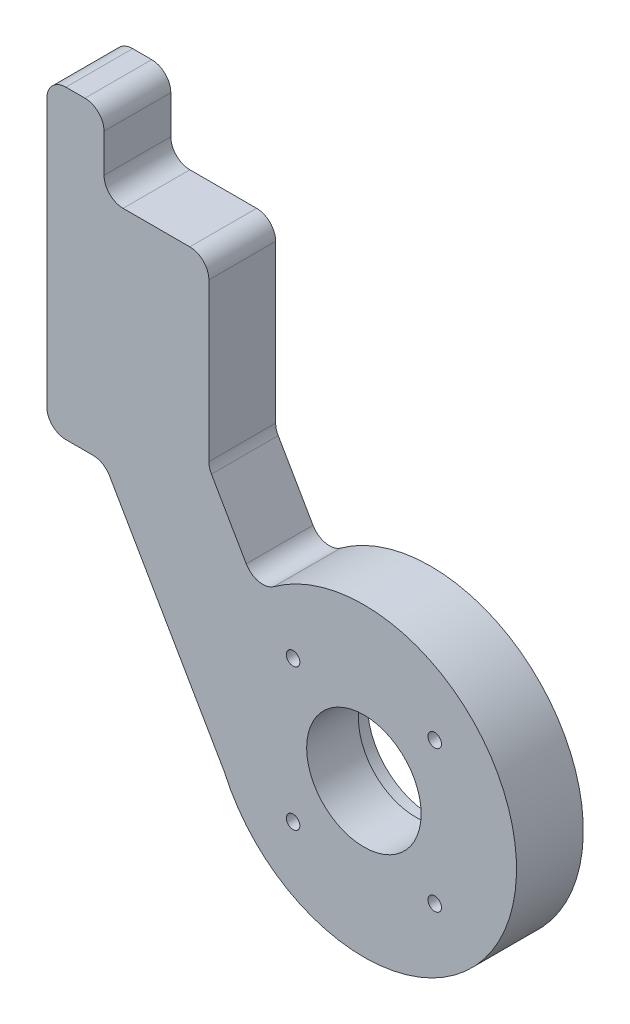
ISO-10303-21;
HEADER;
FILE_DESCRIPTION(('STEP AP214'),'2;1');
FILE_NAME('part.step','',(''),(''),'','','');
FILE_SCHEMA(('AUTOMOTIVE_DESIGN { 1 0 10303 214 1 1 1 1 }'));
ENDSEC;
DATA;
#1=APPLICATION_CONTEXT('core data for automotive mechanical design processes');
#2=APPLICATION_PROTOCOL_DEFINITION('international standard','automotive_design',2000,#1);
#3=PRODUCT_CONTEXT('',#1,'mechanical');
#4=PRODUCT('Part','Part','',(#3));
#5=PRODUCT_RELATED_PRODUCT_CATEGORY('part','',(#4));
#6=PRODUCT_DEFINITION_FORMATION('','',#4);
#7=PRODUCT_DEFINITION_CONTEXT('part definition',#1,'design');
#8=PRODUCT_DEFINITION('design','',#6,#7);
#9=PRODUCT_DEFINITION_SHAPE('','',#8);
#10=(LENGTH_UNIT() NAMED_UNIT(*) SI_UNIT(.MILLI.,.METRE.));
#11=(NAMED_UNIT(*) PLANE_ANGLE_UNIT() SI_UNIT($,.RADIAN.));
#12=(NAMED_UNIT(*) SI_UNIT($,.STERADIAN.) SOLID_ANGLE_UNIT());
#13=UNCERTAINTY_MEASURE_WITH_UNIT(LENGTH_MEASURE(1.E-05),#10,'distance_accuracy_value','');
#14=(GEOMETRIC_REPRESENTATION_CONTEXT(3) GLOBAL_UNCERTAINTY_ASSIGNED_CONTEXT((#13)) GLOBAL_UNIT_ASSIGNED_CONTEXT((#10,
#11,#12)) REPRESENTATION_CONTEXT('',''));
#15=CARTESIAN_POINT('',(0.,0.,0.));
#16=DIRECTION('',(0.,0.,1.));
#17=DIRECTION('',(1.,0.,0.));
#18=AXIS2_PLACEMENT_3D('',#15,#16,#17);
#19=CARTESIAN_POINT('',(-1.87442090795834,15.3373760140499,22.225));
#20=DIRECTION('',(0.,0.,-1.));
#21=DIRECTION('',(-1.,0.,0.));
#22=AXIS2_PLACEMENT_3D('',#19,#20,#21);
#23=CYLINDRICAL_SURFACE('',#22,19.05);
#24=CARTESIAN_POINT('',(-1.87442090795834,15.3373760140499,22.225));
#25=DIRECTION('',(0.,0.,1.));
#26=DIRECTION('',(1.,0.,0.));
#27=AXIS2_PLACEMENT_3D('',#24,#25,#26);
#28=CIRCLE('',#27,19.05);
#29=CARTESIAN_POINT('',(17.1755790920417,15.3373760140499,22.225));
#30=VERTEX_POINT('',#29);
#31=EDGE_CURVE('E206',#30,#30,#28,.T.);
#32=ORIENTED_EDGE('',*,*,#31,.T.);
#33=EDGE_LOOP('',(#32));
#34=FACE_BOUND('',#33,.T.);
#35=CARTESIAN_POINT('',(-1.87442090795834,15.3373760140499,5.));
#36=DIRECTION('',(0.,0.,-1.));
#37=DIRECTION('',(-1.,0.,0.));
#38=AXIS2_PLACEMENT_3D('',#35,#36,#37);
#39=CIRCLE('',#38,19.05);
#40=CARTESIAN_POINT('',(-20.9244209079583,15.3373760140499,5.));
#41=VERTEX_POINT('',#40);
#42=EDGE_CURVE('E51',#41,#41,#39,.T.);
#43=ORIENTED_EDGE('',*,*,#42,.T.);
#44=EDGE_LOOP('',(#43));
#45=FACE_BOUND('',#44,.T.);
#46=ADVANCED_FACE('F47',(#34,#45),#23,.F.);
#47=CARTESIAN_POINT('',(-1.87442090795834,15.3373760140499,22.225));
#48=DIRECTION('',(0.,0.,1.));
#49=DIRECTION('',(1.,0.,0.));
#50=AXIS2_PLACEMENT_3D('',#47,#48,#49);
#51=PLANE('',#50);
#52=CARTESIAN_POINT('',(-25.4444209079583,-8.23262398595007,22.225));
#53=DIRECTION('',(0.,0.,1.));
#54=DIRECTION('',(1.,0.,0.));
#55=AXIS2_PLACEMENT_3D('',#52,#53,#54);
#56=CIRCLE('',#55,2.25);
#57=CARTESIAN_POINT('',(-23.1944209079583,-8.23262398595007,22.225));
#58=VERTEX_POINT('',#57);
#59=EDGE_CURVE('E456',#58,#58,#56,.T.);
#60=ORIENTED_EDGE('',*,*,#59,.F.);
#61=EDGE_LOOP('',(#60));
#62=FACE_BOUND('',#61,.T.);
#63=CARTESIAN_POINT('',(21.6955790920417,-8.23262398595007,22.225));
#64=DIRECTION('',(0.,0.,1.));
#65=DIRECTION('',(1.,0.,0.));
#66=AXIS2_PLACEMENT_3D('',#63,#64,#65);
#67=CIRCLE('',#66,2.25);
#68=CARTESIAN_POINT('',(23.9455790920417,-8.23262398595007,22.225));
#69=VERTEX_POINT('',#68);
#70=EDGE_CURVE('E460',#69,#69,#67,.T.);
#71=ORIENTED_EDGE('',*,*,#70,.F.);
#72=EDGE_LOOP('',(#71));
#73=FACE_BOUND('',#72,.T.);
#74=CARTESIAN_POINT('',(21.6955790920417,38.9073760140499,22.225));
#75=DIRECTION('',(0.,0.,1.));
#76=DIRECTION('',(1.,0.,0.));
#77=AXIS2_PLACEMENT_3D('',#74,#75,#76);
#78=CIRCLE('',#77,2.25);
#79=CARTESIAN_POINT('',(23.9455790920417,38.9073760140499,22.225));
#80=VERTEX_POINT('',#79);
#81=EDGE_CURVE('E455',#80,#80,#78,.T.);
#82=ORIENTED_EDGE('',*,*,#81,.F.);
#83=EDGE_LOOP('',(#82));
#84=FACE_BOUND('',#83,.T.);
#85=CARTESIAN_POINT('',(-25.4444209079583,38.9073760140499,22.225));
#86=DIRECTION('',(0.,0.,1.));
#87=DIRECTION('',(1.,0.,0.));
#88=AXIS2_PLACEMENT_3D('',#85,#86,#87);
#89=CIRCLE('',#88,2.25);
#90=CARTESIAN_POINT('',(-23.1944209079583,38.9073760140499,22.225));
#91=VERTEX_POINT('',#90);
#92=EDGE_CURVE('E227',#91,#91,#89,.T.);
#93=ORIENTED_EDGE('',*,*,#92,.F.);
#94=EDGE_LOOP('',(#93));
#95=FACE_BOUND('',#94,.T.);
#96=DIRECTION('',(1.,0.,0.));
#97=VECTOR('',#96,1.);
#98=CARTESIAN_POINT('',(-107.408653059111,165.713354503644,22.225));
#99=LINE('',#98,#97);
#100=CARTESIAN_POINT('',(-101.058653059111,165.713354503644,22.225));
#101=VERTEX_POINT('',#100);
#102=CARTESIAN_POINT('',(-94.7086530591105,165.713354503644,22.225));
#103=VERTEX_POINT('',#102);
#104=EDGE_CURVE('E382',#101,#103,#99,.T.);
#105=ORIENTED_EDGE('',*,*,#104,.F.);
#106=CARTESIAN_POINT('',(-101.058653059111,159.363354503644,22.225));
#107=DIRECTION('',(0.,0.,1.));
#108=DIRECTION('',(1.,0.,0.));
#109=AXIS2_PLACEMENT_3D('',#106,#107,#108);
#110=CIRCLE('',#109,6.35);
#111=CARTESIAN_POINT('',(-107.408653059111,159.363354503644,22.225));
#112=VERTEX_POINT('',#111);
#113=EDGE_CURVE('E282',#101,#112,#110,.T.);
#114=ORIENTED_EDGE('',*,*,#113,.T.);
#115=DIRECTION('',(0.,1.,0.));
#116=VECTOR('',#115,1.);
#117=CARTESIAN_POINT('',(-107.408653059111,64.1133545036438,22.225));
#118=LINE('',#117,#116);
#119=CARTESIAN_POINT('',(-107.408653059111,70.4633545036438,22.225));
#120=VERTEX_POINT('',#119);
#121=EDGE_CURVE('E372',#120,#112,#118,.T.);
#122=ORIENTED_EDGE('',*,*,#121,.F.);
#123=CARTESIAN_POINT('',(-101.058653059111,70.4633545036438,22.225));
#124=DIRECTION('',(0.,0.,1.));
#125=DIRECTION('',(1.,0.,0.));
#126=AXIS2_PLACEMENT_3D('',#123,#124,#125);
#127=CIRCLE('',#126,6.35);
#128=CARTESIAN_POINT('',(-101.058653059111,64.1133545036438,22.225));
#129=VERTEX_POINT('',#128);
#130=EDGE_CURVE('E71',#120,#129,#127,.T.);
#131=ORIENTED_EDGE('',*,*,#130,.T.);
#132=DIRECTION('',(1.,0.,0.));
#133=VECTOR('',#132,1.);
#134=CARTESIAN_POINT('',(-107.408653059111,64.1133545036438,22.225));
#135=LINE('',#134,#133);
#136=CARTESIAN_POINT('',(-92.0248272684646,64.1133545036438,22.225));
#137=VERTEX_POINT('',#136);
#138=EDGE_CURVE('E386',#129,#137,#135,.T.);
#139=ORIENTED_EDGE('',*,*,#138,.T.);
#140=CARTESIAN_POINT('',(-92.0248272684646,57.7633545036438,22.225));
#141=DIRECTION('',(0.,0.,1.));
#142=DIRECTION('',(1.,0.,0.));
#143=AXIS2_PLACEMENT_3D('',#140,#141,#142);
#144=CIRCLE('',#143,6.35);
#145=CARTESIAN_POINT('',(-86.5255659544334,60.9383545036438,22.225));
#146=VERTEX_POINT('',#145);
#147=EDGE_CURVE('E322',#137,#146,#144,.F.);
#148=ORIENTED_EDGE('',*,*,#147,.T.);
#149=DIRECTION('',(0.5,-0.866025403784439,0.));
#150=VECTOR('',#149,1.);
#151=CARTESIAN_POINT('',(-121.354220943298,121.263354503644,22.225));
#152=LINE('',#151,#150);
#153=CARTESIAN_POINT('',(-48.4942042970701,-4.9338961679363,22.225));
#154=VERTEX_POINT('',#153);
#155=EDGE_CURVE('E217',#146,#154,#152,.T.);
#156=ORIENTED_EDGE('',*,*,#155,.T.);
#157=CARTESIAN_POINT('',(-53.9934656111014,-8.10889616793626,22.225));
#158=DIRECTION('',(0.,0.,1.));
#159=DIRECTION('',(1.,0.,0.));
#160=AXIS2_PLACEMENT_3D('',#157,#158,#159);
#161=CIRCLE('',#160,6.35);
#162=CARTESIAN_POINT('',(-48.2024606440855,-5.50375481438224,22.225));
#163=VERTEX_POINT('',#162);
#164=EDGE_CURVE('E185',#154,#163,#161,.F.);
#165=ORIENTED_EDGE('',*,*,#164,.T.);
#166=CARTESIAN_POINT('',(-1.87442090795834,15.3373760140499,22.225));
#167=DIRECTION('',(0.,0.,1.));
#168=DIRECTION('',(1.,0.,0.));
#169=AXIS2_PLACEMENT_3D('',#166,#167,#168);
#170=CIRCLE('',#169,50.8);
#171=CARTESIAN_POINT('',(-31.7958882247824,56.3903392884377,22.225));
#172=VERTEX_POINT('',#171);
#173=EDGE_CURVE('E195',#163,#172,#170,.T.);
#174=ORIENTED_EDGE('',*,*,#173,.T.);
#175=CARTESIAN_POINT('',(-35.5360716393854,61.5219596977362,22.225));
#176=DIRECTION('',(0.,0.,1.));
#177=DIRECTION('',(1.,0.,0.));
#178=AXIS2_PLACEMENT_3D('',#175,#176,#177);
#179=CIRCLE('',#178,6.35);
#180=CARTESIAN_POINT('',(-41.0353329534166,58.3469596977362,22.225));
#181=VERTEX_POINT('',#180);
#182=EDGE_CURVE('E327',#172,#181,#179,.F.);
#183=ORIENTED_EDGE('',*,*,#182,.T.);
#184=DIRECTION('',(-0.5,0.866025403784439,0.));
#185=VECTOR('',#184,1.);
#186=CARTESIAN_POINT('',(-37.2518930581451,51.7938495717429,22.225));
#187=LINE('',#186,#185);
#188=CARTESIAN_POINT('',(-52.6131078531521,78.4002540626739,22.225));
#189=VERTEX_POINT('',#188);
#190=EDGE_CURVE('E392',#181,#189,#187,.T.);
#191=ORIENTED_EDGE('',*,*,#190,.T.);
#192=CARTESIAN_POINT('',(-47.113846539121,81.5752540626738,22.225));
#193=DIRECTION('',(0.,0.,1.));
#194=DIRECTION('',(1.,0.,0.));
#195=AXIS2_PLACEMENT_3D('',#192,#193,#194);
#196=CIRCLE('',#195,6.35);
#197=CARTESIAN_POINT('',(-53.463846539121,81.5752540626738,22.225));
#198=VERTEX_POINT('',#197);
#199=EDGE_CURVE('E333',#189,#198,#196,.F.);
#200=ORIENTED_EDGE('',*,*,#199,.T.);
#201=DIRECTION('',(0.,-1.,0.));
#202=VECTOR('',#201,1.);
#203=CARTESIAN_POINT('',(-53.463846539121,140.313354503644,22.225));
#204=LINE('',#203,#202);
#205=CARTESIAN_POINT('',(-53.463846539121,133.963354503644,22.225));
#206=VERTEX_POINT('',#205);
#207=EDGE_CURVE('E433',#206,#198,#204,.T.);
#208=ORIENTED_EDGE('',*,*,#207,.F.);
#209=CARTESIAN_POINT('',(-59.813846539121,133.963354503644,22.225));
#210=DIRECTION('',(0.,0.,1.));
#211=DIRECTION('',(1.,0.,0.));
#212=AXIS2_PLACEMENT_3D('',#209,#210,#211);
#213=CIRCLE('',#212,6.35);
#214=CARTESIAN_POINT('',(-59.813846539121,140.313354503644,22.225));
#215=VERTEX_POINT('',#214);
#216=EDGE_CURVE('E277',#206,#215,#213,.T.);
#217=ORIENTED_EDGE('',*,*,#216,.T.);
#218=DIRECTION('',(1.,0.,0.));
#219=VECTOR('',#218,1.);
#220=CARTESIAN_POINT('',(-88.3586530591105,140.313354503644,22.225));
#221=LINE('',#220,#219);
#222=CARTESIAN_POINT('',(-82.0086530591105,140.313354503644,22.225));
#223=VERTEX_POINT('',#222);
#224=EDGE_CURVE('E362',#223,#215,#221,.T.);
#225=ORIENTED_EDGE('',*,*,#224,.F.);
#226=CARTESIAN_POINT('',(-82.0086530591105,146.663354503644,22.225));
#227=DIRECTION('',(0.,0.,1.));
#228=DIRECTION('',(1.,0.,0.));
#229=AXIS2_PLACEMENT_3D('',#226,#227,#228);
#230=CIRCLE('',#229,6.35);
#231=CARTESIAN_POINT('',(-88.3586530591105,146.663354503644,22.225));
#232=VERTEX_POINT('',#231);
#233=EDGE_CURVE('E11',#223,#232,#230,.F.);
#234=ORIENTED_EDGE('',*,*,#233,.T.);
#235=DIRECTION('',(0.,1.,0.));
#236=VECTOR('',#235,1.);
#237=CARTESIAN_POINT('',(-88.3586530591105,64.1133545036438,22.225));
#238=LINE('',#237,#236);
#239=CARTESIAN_POINT('',(-88.3586530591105,159.363354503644,22.225));
#240=VERTEX_POINT('',#239);
#241=EDGE_CURVE('E360',#232,#240,#238,.T.);
#242=ORIENTED_EDGE('',*,*,#241,.T.);
#243=CARTESIAN_POINT('',(-94.7086530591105,159.363354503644,22.225));
#244=DIRECTION('',(0.,0.,1.));
#245=DIRECTION('',(1.,0.,0.));
#246=AXIS2_PLACEMENT_3D('',#243,#244,#245);
#247=CIRCLE('',#246,6.35);
#248=EDGE_CURVE('E274',#240,#103,#247,.T.);
#249=ORIENTED_EDGE('',*,*,#248,.T.);
#250=EDGE_LOOP('',(#105,#114,#122,#131,#139,#148,#156,#165,#174,#183,#191,#200,#208,#217,#225,
#234,#242,#249));
#251=FACE_BOUND('',#250,.T.);
#252=ORIENTED_EDGE('',*,*,#31,.F.);
#253=EDGE_LOOP('',(#252));
#254=FACE_BOUND('',#253,.T.);
#255=ADVANCED_FACE('F358',(#62,#73,#84,#95,#251,#254),#51,.T.);
#256=CARTESIAN_POINT('',(-1.87442090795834,15.3373760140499,0.));
#257=DIRECTION('',(0.,0.,1.));
#258=DIRECTION('',(1.,0.,0.));
#259=AXIS2_PLACEMENT_3D('',#256,#257,#258);
#260=PLANE('',#259);
#261=CARTESIAN_POINT('',(-1.87442090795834,15.3373760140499,0.));
#262=DIRECTION('',(0.,0.,-1.));
#263=DIRECTION('',(-1.,0.,0.));
#264=AXIS2_PLACEMENT_3D('',#261,#262,#263);
#265=CIRCLE('',#264,21.);
#266=CARTESIAN_POINT('',(-22.8744209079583,15.3373760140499,0.));
#267=VERTEX_POINT('',#266);
#268=EDGE_CURVE('E467',#267,#267,#265,.T.);
#269=ORIENTED_EDGE('',*,*,#268,.F.);
#270=EDGE_LOOP('',(#269));
#271=FACE_BOUND('',#270,.T.);
#272=CARTESIAN_POINT('',(-25.4444209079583,-8.23262398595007,0.));
#273=DIRECTION('',(0.,0.,1.));
#274=DIRECTION('',(1.,0.,0.));
#275=AXIS2_PLACEMENT_3D('',#272,#273,#274);
#276=CIRCLE('',#275,2.25);
#277=CARTESIAN_POINT('',(-23.1944209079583,-8.23262398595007,0.));
#278=VERTEX_POINT('',#277);
#279=EDGE_CURVE('E235',#278,#278,#276,.T.);
#280=ORIENTED_EDGE('',*,*,#279,.T.);
#281=EDGE_LOOP('',(#280));
#282=FACE_BOUND('',#281,.T.);
#283=CARTESIAN_POINT('',(21.6955790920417,-8.23262398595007,0.));
#284=DIRECTION('',(0.,0.,1.));
#285=DIRECTION('',(1.,0.,0.));
#286=AXIS2_PLACEMENT_3D('',#283,#284,#285);
#287=CIRCLE('',#286,2.25);
#288=CARTESIAN_POINT('',(23.9455790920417,-8.23262398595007,0.));
#289=VERTEX_POINT('',#288);
#290=EDGE_CURVE('E231',#289,#289,#287,.T.);
#291=ORIENTED_EDGE('',*,*,#290,.T.);
#292=EDGE_LOOP('',(#291));
#293=FACE_BOUND('',#292,.T.);
#294=CARTESIAN_POINT('',(21.6955790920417,38.9073760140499,0.));
#295=DIRECTION('',(0.,0.,1.));
#296=DIRECTION('',(1.,0.,0.));
#297=AXIS2_PLACEMENT_3D('',#294,#295,#296);
#298=CIRCLE('',#297,2.25);
#299=CARTESIAN_POINT('',(23.9455790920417,38.9073760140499,0.));
#300=VERTEX_POINT('',#299);
#301=EDGE_CURVE('E226',#300,#300,#298,.T.);
#302=ORIENTED_EDGE('',*,*,#301,.T.);
#303=EDGE_LOOP('',(#302));
#304=FACE_BOUND('',#303,.T.);
#305=CARTESIAN_POINT('',(-25.4444209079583,38.9073760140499,0.));
#306=DIRECTION('',(0.,0.,1.));
#307=DIRECTION('',(1.,0.,0.));
#308=AXIS2_PLACEMENT_3D('',#305,#306,#307);
#309=CIRCLE('',#308,2.25);
#310=CARTESIAN_POINT('',(-23.1944209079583,38.9073760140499,0.));
#311=VERTEX_POINT('',#310);
#312=EDGE_CURVE('E222',#311,#311,#309,.T.);
#313=ORIENTED_EDGE('',*,*,#312,.T.);
#314=EDGE_LOOP('',(#313));
#315=FACE_BOUND('',#314,.T.);
#316=DIRECTION('',(0.,-1.,0.));
#317=VECTOR('',#316,1.);
#318=CARTESIAN_POINT('',(-107.408653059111,64.1133545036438,0.));
#319=LINE('',#318,#317);
#320=CARTESIAN_POINT('',(-107.408653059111,159.363354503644,0.));
#321=VERTEX_POINT('',#320);
#322=CARTESIAN_POINT('',(-107.408653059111,70.4633545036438,0.));
#323=VERTEX_POINT('',#322);
#324=EDGE_CURVE('E367',#321,#323,#319,.T.);
#325=ORIENTED_EDGE('',*,*,#324,.F.);
#326=CARTESIAN_POINT('',(-101.058653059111,159.363354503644,0.));
#327=DIRECTION('',(0.,0.,1.));
#328=DIRECTION('',(1.,0.,0.));
#329=AXIS2_PLACEMENT_3D('',#326,#327,#328);
#330=CIRCLE('',#329,6.35);
#331=CARTESIAN_POINT('',(-101.058653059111,165.713354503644,0.));
#332=VERTEX_POINT('',#331);
#333=EDGE_CURVE('E264',#321,#332,#330,.F.);
#334=ORIENTED_EDGE('',*,*,#333,.T.);
#335=DIRECTION('',(1.,0.,0.));
#336=VECTOR('',#335,1.);
#337=CARTESIAN_POINT('',(-107.408653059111,165.713354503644,0.));
#338=LINE('',#337,#336);
#339=CARTESIAN_POINT('',(-94.7086530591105,165.713354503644,0.));
#340=VERTEX_POINT('',#339);
#341=EDGE_CURVE('E378',#332,#340,#338,.T.);
#342=ORIENTED_EDGE('',*,*,#341,.T.);
#343=CARTESIAN_POINT('',(-94.7086530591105,159.363354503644,0.));
#344=DIRECTION('',(0.,0.,1.));
#345=DIRECTION('',(1.,0.,0.));
#346=AXIS2_PLACEMENT_3D('',#343,#344,#345);
#347=CIRCLE('',#346,6.35);
#348=CARTESIAN_POINT('',(-88.3586530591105,159.363354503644,0.));
#349=VERTEX_POINT('',#348);
#350=EDGE_CURVE('E255',#340,#349,#347,.F.);
#351=ORIENTED_EDGE('',*,*,#350,.T.);
#352=DIRECTION('',(0.,-1.,0.));
#353=VECTOR('',#352,1.);
#354=CARTESIAN_POINT('',(-88.3586530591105,64.1133545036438,0.));
#355=LINE('',#354,#353);
#356=CARTESIAN_POINT('',(-88.3586530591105,146.663354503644,0.));
#357=VERTEX_POINT('',#356);
#358=EDGE_CURVE('E341',#349,#357,#355,.T.);
#359=ORIENTED_EDGE('',*,*,#358,.T.);
#360=CARTESIAN_POINT('',(-82.0086530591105,146.663354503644,0.));
#361=DIRECTION('',(0.,0.,1.));
#362=DIRECTION('',(1.,0.,0.));
#363=AXIS2_PLACEMENT_3D('',#360,#361,#362);
#364=CIRCLE('',#363,6.35);
#365=CARTESIAN_POINT('',(-82.0086530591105,140.313354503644,0.));
#366=VERTEX_POINT('',#365);
#367=EDGE_CURVE('E57',#357,#366,#364,.T.);
#368=ORIENTED_EDGE('',*,*,#367,.T.);
#369=DIRECTION('',(1.,0.,0.));
#370=VECTOR('',#369,1.);
#371=CARTESIAN_POINT('',(-88.3586530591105,140.313354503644,0.));
#372=LINE('',#371,#370);
#373=CARTESIAN_POINT('',(-59.813846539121,140.313354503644,0.));
#374=VERTEX_POINT('',#373);
#375=EDGE_CURVE('E239',#366,#374,#372,.T.);
#376=ORIENTED_EDGE('',*,*,#375,.T.);
#377=CARTESIAN_POINT('',(-59.813846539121,133.963354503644,0.));
#378=DIRECTION('',(0.,0.,1.));
#379=DIRECTION('',(1.,0.,0.));
#380=AXIS2_PLACEMENT_3D('',#377,#378,#379);
#381=CIRCLE('',#380,6.35);
#382=CARTESIAN_POINT('',(-53.463846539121,133.963354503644,0.));
#383=VERTEX_POINT('',#382);
#384=EDGE_CURVE('E258',#374,#383,#381,.F.);
#385=ORIENTED_EDGE('',*,*,#384,.T.);
#386=DIRECTION('',(0.,-1.,0.));
#387=VECTOR('',#386,1.);
#388=CARTESIAN_POINT('',(-53.463846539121,140.313354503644,0.));
#389=LINE('',#388,#387);
#390=CARTESIAN_POINT('',(-53.463846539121,81.5752540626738,0.));
#391=VERTEX_POINT('',#390);
#392=EDGE_CURVE('E351',#383,#391,#389,.T.);
#393=ORIENTED_EDGE('',*,*,#392,.T.);
#394=CARTESIAN_POINT('',(-47.113846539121,81.5752540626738,0.));
#395=DIRECTION('',(0.,0.,1.));
#396=DIRECTION('',(1.,0.,0.));
#397=AXIS2_PLACEMENT_3D('',#394,#395,#396);
#398=CIRCLE('',#397,6.35);
#399=CARTESIAN_POINT('',(-52.6131078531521,78.4002540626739,0.));
#400=VERTEX_POINT('',#399);
#401=EDGE_CURVE('E330',#391,#400,#398,.T.);
#402=ORIENTED_EDGE('',*,*,#401,.T.);
#403=DIRECTION('',(-0.5,0.866025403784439,0.));
#404=VECTOR('',#403,1.);
#405=CARTESIAN_POINT('',(-37.2518930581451,51.7938495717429,0.));
#406=LINE('',#405,#404);
#407=CARTESIAN_POINT('',(-41.0353329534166,58.3469596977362,0.));
#408=VERTEX_POINT('',#407);
#409=EDGE_CURVE('E205',#408,#400,#406,.T.);
#410=ORIENTED_EDGE('',*,*,#409,.F.);
#411=CARTESIAN_POINT('',(-35.5360716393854,61.5219596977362,0.));
#412=DIRECTION('',(0.,0.,1.));
#413=DIRECTION('',(1.,0.,0.));
#414=AXIS2_PLACEMENT_3D('',#411,#412,#413);
#415=CIRCLE('',#414,6.35);
#416=CARTESIAN_POINT('',(-31.7958882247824,56.3903392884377,0.));
#417=VERTEX_POINT('',#416);
#418=EDGE_CURVE('E203',#408,#417,#415,.T.);
#419=ORIENTED_EDGE('',*,*,#418,.T.);
#420=CARTESIAN_POINT('',(-1.87442090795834,15.3373760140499,0.));
#421=DIRECTION('',(0.,0.,1.));
#422=DIRECTION('',(1.,0.,0.));
#423=AXIS2_PLACEMENT_3D('',#420,#421,#422);
#424=CIRCLE('',#423,50.8);
#425=CARTESIAN_POINT('',(-48.2024606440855,-5.50375481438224,0.));
#426=VERTEX_POINT('',#425);
#427=EDGE_CURVE('E192',#426,#417,#424,.T.);
#428=ORIENTED_EDGE('',*,*,#427,.F.);
#429=CARTESIAN_POINT('',(-53.9934656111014,-8.10889616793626,0.));
#430=DIRECTION('',(0.,0.,1.));
#431=DIRECTION('',(1.,0.,0.));
#432=AXIS2_PLACEMENT_3D('',#429,#430,#431);
#433=CIRCLE('',#432,6.35);
#434=CARTESIAN_POINT('',(-48.4942042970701,-4.9338961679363,0.));
#435=VERTEX_POINT('',#434);
#436=EDGE_CURVE('E174',#426,#435,#433,.T.);
#437=ORIENTED_EDGE('',*,*,#436,.T.);
#438=DIRECTION('',(0.5,-0.866025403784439,0.));
#439=VECTOR('',#438,1.);
#440=CARTESIAN_POINT('',(-121.354220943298,121.263354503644,0.));
#441=LINE('',#440,#439);
#442=CARTESIAN_POINT('',(-86.5255659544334,60.9383545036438,0.));
#443=VERTEX_POINT('',#442);
#444=EDGE_CURVE('E211',#443,#435,#441,.T.);
#445=ORIENTED_EDGE('',*,*,#444,.F.);
#446=CARTESIAN_POINT('',(-92.0248272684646,57.7633545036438,0.));
#447=DIRECTION('',(0.,0.,1.));
#448=DIRECTION('',(1.,0.,0.));
#449=AXIS2_PLACEMENT_3D('',#446,#447,#448);
#450=CIRCLE('',#449,6.35);
#451=CARTESIAN_POINT('',(-92.0248272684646,64.1133545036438,0.));
#452=VERTEX_POINT('',#451);
#453=EDGE_CURVE('E319',#443,#452,#450,.T.);
#454=ORIENTED_EDGE('',*,*,#453,.T.);
#455=DIRECTION('',(1.,0.,0.));
#456=VECTOR('',#455,1.);
#457=CARTESIAN_POINT('',(-107.408653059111,64.1133545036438,0.));
#458=LINE('',#457,#456);
#459=CARTESIAN_POINT('',(-101.058653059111,64.1133545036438,0.));
#460=VERTEX_POINT('',#459);
#461=EDGE_CURVE('E214',#460,#452,#458,.T.);
#462=ORIENTED_EDGE('',*,*,#461,.F.);
#463=CARTESIAN_POINT('',(-101.058653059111,70.4633545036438,0.));
#464=DIRECTION('',(0.,0.,1.));
#465=DIRECTION('',(1.,0.,0.));
#466=AXIS2_PLACEMENT_3D('',#463,#464,#465);
#467=CIRCLE('',#466,6.35);
#468=EDGE_CURVE('E261',#460,#323,#467,.F.);
#469=ORIENTED_EDGE('',*,*,#468,.T.);
#470=EDGE_LOOP('',(#325,#334,#342,#351,#359,#368,#376,#385,#393,#402,#410,#419,#428,#437,#445,
#454,#462,#469));
#471=FACE_BOUND('',#470,.T.);
#472=ADVANCED_FACE('F201',(#271,#282,#293,#304,#315,#471),#260,.F.);
#473=CARTESIAN_POINT('',(-1.87442090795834,15.3373760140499,22.225));
#474=DIRECTION('',(0.,0.,-1.));
#475=DIRECTION('',(-1.,0.,0.));
#476=AXIS2_PLACEMENT_3D('',#473,#474,#475);
#477=CYLINDRICAL_SURFACE('',#476,50.8);
#478=ORIENTED_EDGE('',*,*,#173,.F.);
#479=DIRECTION('',(0.,0.,-1.));
#480=VECTOR('',#479,1.);
#481=CARTESIAN_POINT('',(-48.2024606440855,-5.50375481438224,22.225));
#482=LINE('',#481,#480);
#483=EDGE_CURVE('E178',#163,#426,#482,.T.);
#484=ORIENTED_EDGE('',*,*,#483,.T.);
#485=ORIENTED_EDGE('',*,*,#427,.T.);
#486=DIRECTION('',(0.,0.,-1.));
#487=VECTOR('',#486,1.);
#488=CARTESIAN_POINT('',(-31.7958882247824,56.3903392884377,22.225));
#489=LINE('',#488,#487);
#490=EDGE_CURVE('E198',#417,#172,#489,.F.);
#491=ORIENTED_EDGE('',*,*,#490,.T.);
#492=EDGE_LOOP('',(#478,#484,#485,#491));
#493=FACE_BOUND('',#492,.T.);
#494=ADVANCED_FACE('F191',(#493),#477,.T.);
#495=CARTESIAN_POINT('',(-37.2518930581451,51.7938495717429,22.225));
#496=DIRECTION('',(-0.866025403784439,-0.5,0.));
#497=DIRECTION('',(0.5,-0.866025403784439,0.));
#498=AXIS2_PLACEMENT_3D('',#495,#496,#497);
#499=PLANE('',#498);
#500=ORIENTED_EDGE('',*,*,#190,.F.);
#501=DIRECTION('',(0.,0.,1.));
#502=VECTOR('',#501,1.);
#503=CARTESIAN_POINT('',(-41.0353329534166,58.3469596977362,0.));
#504=LINE('',#503,#502);
#505=EDGE_CURVE('E293',#181,#408,#504,.F.);
#506=ORIENTED_EDGE('',*,*,#505,.T.);
#507=ORIENTED_EDGE('',*,*,#409,.T.);
#508=DIRECTION('',(0.,0.,-1.));
#509=VECTOR('',#508,1.);
#510=CARTESIAN_POINT('',(-52.6131078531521,78.4002540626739,22.225));
#511=LINE('',#510,#509);
#512=EDGE_CURVE('E290',#400,#189,#511,.F.);
#513=ORIENTED_EDGE('',*,*,#512,.T.);
#514=EDGE_LOOP('',(#500,#506,#507,#513));
#515=FACE_BOUND('',#514,.T.);
#516=ADVANCED_FACE('F507',(#515),#499,.F.);
#517=CARTESIAN_POINT('',(-121.354220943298,121.263354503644,22.225));
#518=DIRECTION('',(0.866025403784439,0.5,0.));
#519=DIRECTION('',(-0.5,0.866025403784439,0.));
#520=AXIS2_PLACEMENT_3D('',#517,#518,#519);
#521=PLANE('',#520);
#522=ORIENTED_EDGE('',*,*,#444,.T.);
#523=DIRECTION('',(0.,0.,1.));
#524=VECTOR('',#523,1.);
#525=CARTESIAN_POINT('',(-48.4942042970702,-4.93389616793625,22.225));
#526=LINE('',#525,#524);
#527=EDGE_CURVE('E179',#435,#154,#526,.T.);
#528=ORIENTED_EDGE('',*,*,#527,.T.);
#529=ORIENTED_EDGE('',*,*,#155,.F.);
#530=DIRECTION('',(0.,0.,-1.));
#531=VECTOR('',#530,1.);
#532=CARTESIAN_POINT('',(-86.5255659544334,60.9383545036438,0.));
#533=LINE('',#532,#531);
#534=EDGE_CURVE('E197',#146,#443,#533,.T.);
#535=ORIENTED_EDGE('',*,*,#534,.T.);
#536=EDGE_LOOP('',(#522,#528,#529,#535));
#537=FACE_BOUND('',#536,.T.);
#538=ADVANCED_FACE('F403',(#537),#521,.F.);
#539=CARTESIAN_POINT('',(-107.408653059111,64.1133545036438,0.));
#540=DIRECTION('',(0.,1.,0.));
#541=DIRECTION('',(0.,0.,1.));
#542=AXIS2_PLACEMENT_3D('',#539,#540,#541);
#543=PLANE('',#542);
#544=ORIENTED_EDGE('',*,*,#461,.T.);
#545=DIRECTION('',(0.,0.,-1.));
#546=VECTOR('',#545,1.);
#547=CARTESIAN_POINT('',(-92.0248272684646,64.1133545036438,22.225));
#548=LINE('',#547,#546);
#549=EDGE_CURVE('E64',#452,#137,#548,.F.);
#550=ORIENTED_EDGE('',*,*,#549,.T.);
#551=ORIENTED_EDGE('',*,*,#138,.F.);
#552=DIRECTION('',(0.,0.,1.));
#553=VECTOR('',#552,1.);
#554=CARTESIAN_POINT('',(-101.058653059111,64.1133545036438,0.));
#555=LINE('',#554,#553);
#556=EDGE_CURVE('E285',#129,#460,#555,.F.);
#557=ORIENTED_EDGE('',*,*,#556,.T.);
#558=EDGE_LOOP('',(#544,#550,#551,#557));
#559=FACE_BOUND('',#558,.T.);
#560=ADVANCED_FACE('F408',(#559),#543,.F.);
#561=CARTESIAN_POINT('',(-107.408653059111,165.713354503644,0.));
#562=DIRECTION('',(0.,-1.,0.));
#563=DIRECTION('',(0.,0.,-1.));
#564=AXIS2_PLACEMENT_3D('',#561,#562,#563);
#565=PLANE('',#564);
#566=ORIENTED_EDGE('',*,*,#341,.F.);
#567=DIRECTION('',(0.,0.,-1.));
#568=VECTOR('',#567,1.);
#569=CARTESIAN_POINT('',(-101.058653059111,165.713354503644,0.));
#570=LINE('',#569,#568);
#571=EDGE_CURVE('E271',#332,#101,#570,.F.);
#572=ORIENTED_EDGE('',*,*,#571,.T.);
#573=ORIENTED_EDGE('',*,*,#104,.T.);
#574=DIRECTION('',(0.,0.,-1.));
#575=VECTOR('',#574,1.);
#576=CARTESIAN_POINT('',(-94.7086530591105,165.713354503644,0.));
#577=LINE('',#576,#575);
#578=EDGE_CURVE('E267',#103,#340,#577,.T.);
#579=ORIENTED_EDGE('',*,*,#578,.T.);
#580=EDGE_LOOP('',(#566,#572,#573,#579));
#581=FACE_BOUND('',#580,.T.);
#582=ADVANCED_FACE('F423',(#581),#565,.F.);
#583=CARTESIAN_POINT('',(-107.408653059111,0.,0.));
#584=DIRECTION('',(1.,0.,0.));
#585=DIRECTION('',(0.,0.,-1.));
#586=AXIS2_PLACEMENT_3D('',#583,#584,#585);
#587=PLANE('',#586);
#588=CARTESIAN_POINT('',(-107.408653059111,153.013354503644,11.1125));
#589=DIRECTION('',(-1.,0.,0.));
#590=DIRECTION('',(0.,0.,1.));
#591=AXIS2_PLACEMENT_3D('',#588,#589,#590);
#592=CIRCLE('',#591,4.6);
#593=CARTESIAN_POINT('',(-107.408653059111,153.013354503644,15.7125));
#594=VERTEX_POINT('',#593);
#595=EDGE_CURVE('E437',#594,#594,#592,.T.);
#596=ORIENTED_EDGE('',*,*,#595,.F.);
#597=EDGE_LOOP('',(#596));
#598=FACE_BOUND('',#597,.T.);
#599=CARTESIAN_POINT('',(-107.408653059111,76.8133545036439,11.1125));
#600=DIRECTION('',(-1.,0.,0.));
#601=DIRECTION('',(0.,0.,1.));
#602=AXIS2_PLACEMENT_3D('',#599,#600,#601);
#603=CIRCLE('',#602,4.6);
#604=CARTESIAN_POINT('',(-107.408653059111,76.8133545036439,15.7125));
#605=VERTEX_POINT('',#604);
#606=EDGE_CURVE('E432',#605,#605,#603,.T.);
#607=ORIENTED_EDGE('',*,*,#606,.F.);
#608=EDGE_LOOP('',(#607));
#609=FACE_BOUND('',#608,.T.);
#610=ORIENTED_EDGE('',*,*,#121,.T.);
#611=DIRECTION('',(0.,0.,-1.));
#612=VECTOR('',#611,1.);
#613=CARTESIAN_POINT('',(-107.408653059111,159.363354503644,0.));
#614=LINE('',#613,#612);
#615=EDGE_CURVE('E251',#112,#321,#614,.T.);
#616=ORIENTED_EDGE('',*,*,#615,.T.);
#617=ORIENTED_EDGE('',*,*,#324,.T.);
#618=DIRECTION('',(0.,0.,1.));
#619=VECTOR('',#618,1.);
#620=CARTESIAN_POINT('',(-107.408653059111,70.4633545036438,0.));
#621=LINE('',#620,#619);
#622=EDGE_CURVE('E247',#323,#120,#621,.T.);
#623=ORIENTED_EDGE('',*,*,#622,.T.);
#624=EDGE_LOOP('',(#610,#616,#617,#623));
#625=FACE_BOUND('',#624,.T.);
#626=ADVANCED_FACE('F415',(#598,#609,#625),#587,.F.);
#627=CARTESIAN_POINT('',(-88.3586530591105,0.,0.));
#628=DIRECTION('',(1.,0.,0.));
#629=DIRECTION('',(0.,0.,-1.));
#630=AXIS2_PLACEMENT_3D('',#627,#628,#629);
#631=PLANE('',#630);
#632=ORIENTED_EDGE('',*,*,#241,.F.);
#633=DIRECTION('',(0.,0.,-1.));
#634=VECTOR('',#633,1.);
#635=CARTESIAN_POINT('',(-88.3586530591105,146.663354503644,0.));
#636=LINE('',#635,#634);
#637=EDGE_CURVE('E186',#232,#357,#636,.T.);
#638=ORIENTED_EDGE('',*,*,#637,.T.);
#639=ORIENTED_EDGE('',*,*,#358,.F.);
#640=DIRECTION('',(0.,0.,-1.));
#641=VECTOR('',#640,1.);
#642=CARTESIAN_POINT('',(-88.3586530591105,159.363354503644,22.225));
#643=LINE('',#642,#641);
#644=EDGE_CURVE('E311',#349,#240,#643,.F.);
#645=ORIENTED_EDGE('',*,*,#644,.T.);
#646=EDGE_LOOP('',(#632,#638,#639,#645));
#647=FACE_BOUND('',#646,.T.);
#648=ADVANCED_FACE('F364',(#647),#631,.T.);
#649=CARTESIAN_POINT('',(-94.7086530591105,76.8133545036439,11.1125));
#650=DIRECTION('',(-1.,0.,0.));
#651=DIRECTION('',(0.,0.,1.));
#652=AXIS2_PLACEMENT_3D('',#649,#650,#651);
#653=CYLINDRICAL_SURFACE('',#652,4.6);
#654=CARTESIAN_POINT('',(-94.7086530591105,76.8133545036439,11.1125));
#655=DIRECTION('',(-1.,0.,0.));
#656=DIRECTION('',(0.,0.,1.));
#657=AXIS2_PLACEMENT_3D('',#654,#655,#656);
#658=CIRCLE('',#657,4.6);
#659=CARTESIAN_POINT('',(-94.7086530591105,76.8133545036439,15.7125));
#660=VERTEX_POINT('',#659);
#661=EDGE_CURVE('E428',#660,#660,#658,.T.);
#662=ORIENTED_EDGE('',*,*,#661,.F.);
#663=EDGE_LOOP('',(#662));
#664=FACE_BOUND('',#663,.T.);
#665=ORIENTED_EDGE('',*,*,#606,.T.);
#666=EDGE_LOOP('',(#665));
#667=FACE_BOUND('',#666,.T.);
#668=ADVANCED_FACE('F714',(#664,#667),#653,.F.);
#669=CARTESIAN_POINT('',(-94.7086530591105,76.8133545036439,11.1125));
#670=DIRECTION('',(-1.,0.,0.));
#671=DIRECTION('',(0.,0.,1.));
#672=AXIS2_PLACEMENT_3D('',#669,#670,#671);
#673=PLANE('',#672);
#674=ORIENTED_EDGE('',*,*,#661,.T.);
#675=EDGE_LOOP('',(#674));
#676=FACE_BOUND('',#675,.T.);
#677=ADVANCED_FACE('F726',(#676),#673,.T.);
#678=CARTESIAN_POINT('',(-94.7086530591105,153.013354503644,11.1125));
#679=DIRECTION('',(-1.,0.,0.));
#680=DIRECTION('',(0.,0.,1.));
#681=AXIS2_PLACEMENT_3D('',#678,#679,#680);
#682=CYLINDRICAL_SURFACE('',#681,4.6);
#683=CARTESIAN_POINT('',(-94.7086530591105,153.013354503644,11.1125));
#684=DIRECTION('',(-1.,0.,0.));
#685=DIRECTION('',(0.,0.,1.));
#686=AXIS2_PLACEMENT_3D('',#683,#684,#685);
#687=CIRCLE('',#686,4.6);
#688=CARTESIAN_POINT('',(-94.7086530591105,153.013354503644,15.7125));
#689=VERTEX_POINT('',#688);
#690=EDGE_CURVE('E374',#689,#689,#687,.T.);
#691=ORIENTED_EDGE('',*,*,#690,.F.);
#692=EDGE_LOOP('',(#691));
#693=FACE_BOUND('',#692,.T.);
#694=ORIENTED_EDGE('',*,*,#595,.T.);
#695=EDGE_LOOP('',(#694));
#696=FACE_BOUND('',#695,.T.);
#697=ADVANCED_FACE('F736',(#693,#696),#682,.F.);
#698=CARTESIAN_POINT('',(-94.7086530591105,153.013354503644,11.1125));
#699=DIRECTION('',(-1.,0.,0.));
#700=DIRECTION('',(0.,0.,1.));
#701=AXIS2_PLACEMENT_3D('',#698,#699,#700);
#702=PLANE('',#701);
#703=ORIENTED_EDGE('',*,*,#690,.T.);
#704=EDGE_LOOP('',(#703));
#705=FACE_BOUND('',#704,.T.);
#706=ADVANCED_FACE('F581',(#705),#702,.T.);
#707=CARTESIAN_POINT('',(-53.463846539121,140.313354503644,22.225));
#708=DIRECTION('',(1.,0.,0.));
#709=DIRECTION('',(0.,1.,0.));
#710=AXIS2_PLACEMENT_3D('',#707,#708,#709);
#711=PLANE('',#710);
#712=ORIENTED_EDGE('',*,*,#207,.T.);
#713=DIRECTION('',(0.,0.,-1.));
#714=VECTOR('',#713,1.);
#715=CARTESIAN_POINT('',(-53.463846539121,81.5752540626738,22.225));
#716=LINE('',#715,#714);
#717=EDGE_CURVE('E300',#198,#391,#716,.T.);
#718=ORIENTED_EDGE('',*,*,#717,.T.);
#719=ORIENTED_EDGE('',*,*,#392,.F.);
#720=DIRECTION('',(0.,0.,-1.));
#721=VECTOR('',#720,1.);
#722=CARTESIAN_POINT('',(-53.463846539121,133.963354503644,22.225));
#723=LINE('',#722,#721);
#724=EDGE_CURVE('E297',#383,#206,#723,.F.);
#725=ORIENTED_EDGE('',*,*,#724,.T.);
#726=EDGE_LOOP('',(#712,#718,#719,#725));
#727=FACE_BOUND('',#726,.T.);
#728=ADVANCED_FACE('F575',(#727),#711,.T.);
#729=CARTESIAN_POINT('',(-88.3586530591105,140.313354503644,22.225));
#730=DIRECTION('',(0.,1.,0.));
#731=DIRECTION('',(0.,0.,1.));
#732=AXIS2_PLACEMENT_3D('',#729,#730,#731);
#733=PLANE('',#732);
#734=ORIENTED_EDGE('',*,*,#224,.T.);
#735=DIRECTION('',(0.,0.,-1.));
#736=VECTOR('',#735,1.);
#737=CARTESIAN_POINT('',(-59.813846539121,140.313354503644,22.225));
#738=LINE('',#737,#736);
#739=EDGE_CURVE('E307',#215,#374,#738,.T.);
#740=ORIENTED_EDGE('',*,*,#739,.T.);
#741=ORIENTED_EDGE('',*,*,#375,.F.);
#742=DIRECTION('',(0.,0.,-1.));
#743=VECTOR('',#742,1.);
#744=CARTESIAN_POINT('',(-82.0086530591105,140.313354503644,22.225));
#745=LINE('',#744,#743);
#746=EDGE_CURVE('E304',#366,#223,#745,.F.);
#747=ORIENTED_EDGE('',*,*,#746,.T.);
#748=EDGE_LOOP('',(#734,#740,#741,#747));
#749=FACE_BOUND('',#748,.T.);
#750=ADVANCED_FACE('F347',(#749),#733,.T.);
#751=CARTESIAN_POINT('',(-25.4444209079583,38.9073760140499,-28.829));
#752=DIRECTION('',(0.,0.,1.));
#753=DIRECTION('',(1.,0.,0.));
#754=AXIS2_PLACEMENT_3D('',#751,#752,#753);
#755=CYLINDRICAL_SURFACE('',#754,2.25);
#756=ORIENTED_EDGE('',*,*,#92,.T.);
#757=EDGE_LOOP('',(#756));
#758=FACE_BOUND('',#757,.T.);
#759=ORIENTED_EDGE('',*,*,#312,.F.);
#760=EDGE_LOOP('',(#759));
#761=FACE_BOUND('',#760,.T.);
#762=ADVANCED_FACE('F593',(#758,#761),#755,.F.);
#763=CARTESIAN_POINT('',(21.6955790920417,38.9073760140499,-28.829));
#764=DIRECTION('',(0.,0.,1.));
#765=DIRECTION('',(1.,0.,0.));
#766=AXIS2_PLACEMENT_3D('',#763,#764,#765);
#767=CYLINDRICAL_SURFACE('',#766,2.25);
#768=ORIENTED_EDGE('',*,*,#81,.T.);
#769=EDGE_LOOP('',(#768));
#770=FACE_BOUND('',#769,.T.);
#771=ORIENTED_EDGE('',*,*,#301,.F.);
#772=EDGE_LOOP('',(#771));
#773=FACE_BOUND('',#772,.T.);
#774=ADVANCED_FACE('F602',(#770,#773),#767,.F.);
#775=CARTESIAN_POINT('',(21.6955790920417,-8.23262398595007,-28.829));
#776=DIRECTION('',(0.,0.,1.));
#777=DIRECTION('',(1.,0.,0.));
#778=AXIS2_PLACEMENT_3D('',#775,#776,#777);
#779=CYLINDRICAL_SURFACE('',#778,2.25);
#780=ORIENTED_EDGE('',*,*,#70,.T.);
#781=EDGE_LOOP('',(#780));
#782=FACE_BOUND('',#781,.T.);
#783=ORIENTED_EDGE('',*,*,#290,.F.);
#784=EDGE_LOOP('',(#783));
#785=FACE_BOUND('',#784,.T.);
#786=ADVANCED_FACE('F613',(#782,#785),#779,.F.);
#787=CARTESIAN_POINT('',(-25.4444209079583,-8.23262398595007,-28.829));
#788=DIRECTION('',(0.,0.,1.));
#789=DIRECTION('',(1.,0.,0.));
#790=AXIS2_PLACEMENT_3D('',#787,#788,#789);
#791=CYLINDRICAL_SURFACE('',#790,2.25);
#792=ORIENTED_EDGE('',*,*,#59,.T.);
#793=EDGE_LOOP('',(#792));
#794=FACE_BOUND('',#793,.T.);
#795=ORIENTED_EDGE('',*,*,#279,.F.);
#796=EDGE_LOOP('',(#795));
#797=FACE_BOUND('',#796,.T.);
#798=ADVANCED_FACE('F515',(#794,#797),#791,.F.);
#799=CARTESIAN_POINT('',(-53.9934656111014,-8.10889616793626,22.225));
#800=DIRECTION('',(0.,0.,-1.));
#801=DIRECTION('',(-1.,0.,0.));
#802=AXIS2_PLACEMENT_3D('',#799,#800,#801);
#803=CYLINDRICAL_SURFACE('',#802,6.35);
#804=ORIENTED_EDGE('',*,*,#164,.F.);
#805=ORIENTED_EDGE('',*,*,#527,.F.);
#806=ORIENTED_EDGE('',*,*,#436,.F.);
#807=ORIENTED_EDGE('',*,*,#483,.F.);
#808=EDGE_LOOP('',(#804,#805,#806,#807));
#809=FACE_BOUND('',#808,.T.);
#810=ADVANCED_FACE('F177',(#809),#803,.F.);
#811=CARTESIAN_POINT('',(-101.058653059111,159.363354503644,0.));
#812=DIRECTION('',(0.,0.,-1.));
#813=DIRECTION('',(-1.,0.,0.));
#814=AXIS2_PLACEMENT_3D('',#811,#812,#813);
#815=CYLINDRICAL_SURFACE('',#814,6.35);
#816=ORIENTED_EDGE('',*,*,#113,.F.);
#817=ORIENTED_EDGE('',*,*,#571,.F.);
#818=ORIENTED_EDGE('',*,*,#333,.F.);
#819=ORIENTED_EDGE('',*,*,#615,.F.);
#820=EDGE_LOOP('',(#816,#817,#818,#819));
#821=FACE_BOUND('',#820,.T.);
#822=ADVANCED_FACE('F419',(#821),#815,.T.);
#823=CARTESIAN_POINT('',(-92.0248272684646,57.7633545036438,22.225));
#824=DIRECTION('',(0.,0.,1.));
#825=DIRECTION('',(1.,0.,0.));
#826=AXIS2_PLACEMENT_3D('',#823,#824,#825);
#827=CYLINDRICAL_SURFACE('',#826,6.35);
#828=ORIENTED_EDGE('',*,*,#147,.F.);
#829=ORIENTED_EDGE('',*,*,#549,.F.);
#830=ORIENTED_EDGE('',*,*,#453,.F.);
#831=ORIENTED_EDGE('',*,*,#534,.F.);
#832=EDGE_LOOP('',(#828,#829,#830,#831));
#833=FACE_BOUND('',#832,.T.);
#834=ADVANCED_FACE('F405',(#833),#827,.F.);
#835=CARTESIAN_POINT('',(-101.058653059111,70.4633545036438,0.));
#836=DIRECTION('',(0.,0.,1.));
#837=DIRECTION('',(1.,0.,0.));
#838=AXIS2_PLACEMENT_3D('',#835,#836,#837);
#839=CYLINDRICAL_SURFACE('',#838,6.35);
#840=ORIENTED_EDGE('',*,*,#468,.F.);
#841=ORIENTED_EDGE('',*,*,#556,.F.);
#842=ORIENTED_EDGE('',*,*,#130,.F.);
#843=ORIENTED_EDGE('',*,*,#622,.F.);
#844=EDGE_LOOP('',(#840,#841,#842,#843));
#845=FACE_BOUND('',#844,.T.);
#846=ADVANCED_FACE('F411',(#845),#839,.T.);
#847=CARTESIAN_POINT('',(-35.5360716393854,61.5219596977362,22.225));
#848=DIRECTION('',(0.,0.,-1.));
#849=DIRECTION('',(-1.,0.,0.));
#850=AXIS2_PLACEMENT_3D('',#847,#848,#849);
#851=CYLINDRICAL_SURFACE('',#850,6.35);
#852=ORIENTED_EDGE('',*,*,#182,.F.);
#853=ORIENTED_EDGE('',*,*,#490,.F.);
#854=ORIENTED_EDGE('',*,*,#418,.F.);
#855=ORIENTED_EDGE('',*,*,#505,.F.);
#856=EDGE_LOOP('',(#852,#853,#854,#855));
#857=FACE_BOUND('',#856,.T.);
#858=ADVANCED_FACE('F522',(#857),#851,.F.);
#859=CARTESIAN_POINT('',(-47.113846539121,81.5752540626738,22.225));
#860=DIRECTION('',(0.,0.,-1.));
#861=DIRECTION('',(-1.,0.,0.));
#862=AXIS2_PLACEMENT_3D('',#859,#860,#861);
#863=CYLINDRICAL_SURFACE('',#862,6.35);
#864=ORIENTED_EDGE('',*,*,#199,.F.);
#865=ORIENTED_EDGE('',*,*,#512,.F.);
#866=ORIENTED_EDGE('',*,*,#401,.F.);
#867=ORIENTED_EDGE('',*,*,#717,.F.);
#868=EDGE_LOOP('',(#864,#865,#866,#867));
#869=FACE_BOUND('',#868,.T.);
#870=ADVANCED_FACE('F525',(#869),#863,.F.);
#871=CARTESIAN_POINT('',(-59.813846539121,133.963354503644,22.225));
#872=DIRECTION('',(0.,0.,-1.));
#873=DIRECTION('',(-1.,0.,0.));
#874=AXIS2_PLACEMENT_3D('',#871,#872,#873);
#875=CYLINDRICAL_SURFACE('',#874,6.35);
#876=ORIENTED_EDGE('',*,*,#216,.F.);
#877=ORIENTED_EDGE('',*,*,#724,.F.);
#878=ORIENTED_EDGE('',*,*,#384,.F.);
#879=ORIENTED_EDGE('',*,*,#739,.F.);
#880=EDGE_LOOP('',(#876,#877,#878,#879));
#881=FACE_BOUND('',#880,.T.);
#882=ADVANCED_FACE('F529',(#881),#875,.T.);
#883=CARTESIAN_POINT('',(-82.0086530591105,146.663354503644,0.));
#884=DIRECTION('',(0.,0.,1.));
#885=DIRECTION('',(1.,0.,0.));
#886=AXIS2_PLACEMENT_3D('',#883,#884,#885);
#887=CYLINDRICAL_SURFACE('',#886,6.35);
#888=ORIENTED_EDGE('',*,*,#233,.F.);
#889=ORIENTED_EDGE('',*,*,#746,.F.);
#890=ORIENTED_EDGE('',*,*,#367,.F.);
#891=ORIENTED_EDGE('',*,*,#637,.F.);
#892=EDGE_LOOP('',(#888,#889,#890,#891));
#893=FACE_BOUND('',#892,.T.);
#894=ADVANCED_FACE('F354',(#893),#887,.F.);
#895=CARTESIAN_POINT('',(-94.7086530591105,159.363354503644,0.));
#896=DIRECTION('',(0.,0.,1.));
#897=DIRECTION('',(1.,0.,0.));
#898=AXIS2_PLACEMENT_3D('',#895,#896,#897);
#899=CYLINDRICAL_SURFACE('',#898,6.35);
#900=ORIENTED_EDGE('',*,*,#248,.F.);
#901=ORIENTED_EDGE('',*,*,#644,.F.);
#902=ORIENTED_EDGE('',*,*,#350,.F.);
#903=ORIENTED_EDGE('',*,*,#578,.F.);
#904=EDGE_LOOP('',(#900,#901,#902,#903));
#905=FACE_BOUND('',#904,.T.);
#906=ADVANCED_FACE('F49',(#905),#899,.T.);
#907=CARTESIAN_POINT('',(-1.87442090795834,15.3373760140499,5.));
#908=DIRECTION('',(0.,0.,-1.));
#909=DIRECTION('',(-1.,0.,0.));
#910=AXIS2_PLACEMENT_3D('',#907,#908,#909);
#911=CYLINDRICAL_SURFACE('',#910,21.);
#912=CARTESIAN_POINT('',(-1.87442090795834,15.3373760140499,5.));
#913=DIRECTION('',(0.,0.,-1.));
#914=DIRECTION('',(-1.,0.,0.));
#915=AXIS2_PLACEMENT_3D('',#912,#913,#914);
#916=CIRCLE('',#915,21.);
#917=CARTESIAN_POINT('',(-22.8744209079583,15.3373760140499,5.));
#918=VERTEX_POINT('',#917);
#919=EDGE_CURVE('E471',#918,#918,#916,.T.);
#920=ORIENTED_EDGE('',*,*,#919,.F.);
#921=EDGE_LOOP('',(#920));
#922=FACE_BOUND('',#921,.T.);
#923=ORIENTED_EDGE('',*,*,#268,.T.);
#924=EDGE_LOOP('',(#923));
#925=FACE_BOUND('',#924,.T.);
#926=ADVANCED_FACE('F483',(#922,#925),#911,.F.);
#927=CARTESIAN_POINT('',(-1.87442090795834,15.3373760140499,5.));
#928=DIRECTION('',(0.,0.,-1.));
#929=DIRECTION('',(-1.,0.,0.));
#930=AXIS2_PLACEMENT_3D('',#927,#928,#929);
#931=PLANE('',#930);
#932=ORIENTED_EDGE('',*,*,#42,.F.);
#933=EDGE_LOOP('',(#932));
#934=FACE_BOUND('',#933,.T.);
#935=ORIENTED_EDGE('',*,*,#919,.T.);
#936=EDGE_LOOP('',(#935));
#937=FACE_BOUND('',#936,.T.);
#938=ADVANCED_FACE('F481',(#934,#937),#931,.T.);
#939=CLOSED_SHELL('',(#46,#255,#472,#494,#516,#538,#560,#582,#626,#648,#668,#677,#697,#706,#728,
#750,#762,#774,#786,#798,#810,#822,#834,#846,#858,#870,#882,#894,#906,#926,#938));
#940=MANIFOLD_SOLID_BREP('B2',#939);
#941=ADVANCED_BREP_SHAPE_REPRESENTATION('',(#18,#940),#14);
#942=SHAPE_DEFINITION_REPRESENTATION(#9,#941);
ENDSEC;
END-ISO-10303-21;
